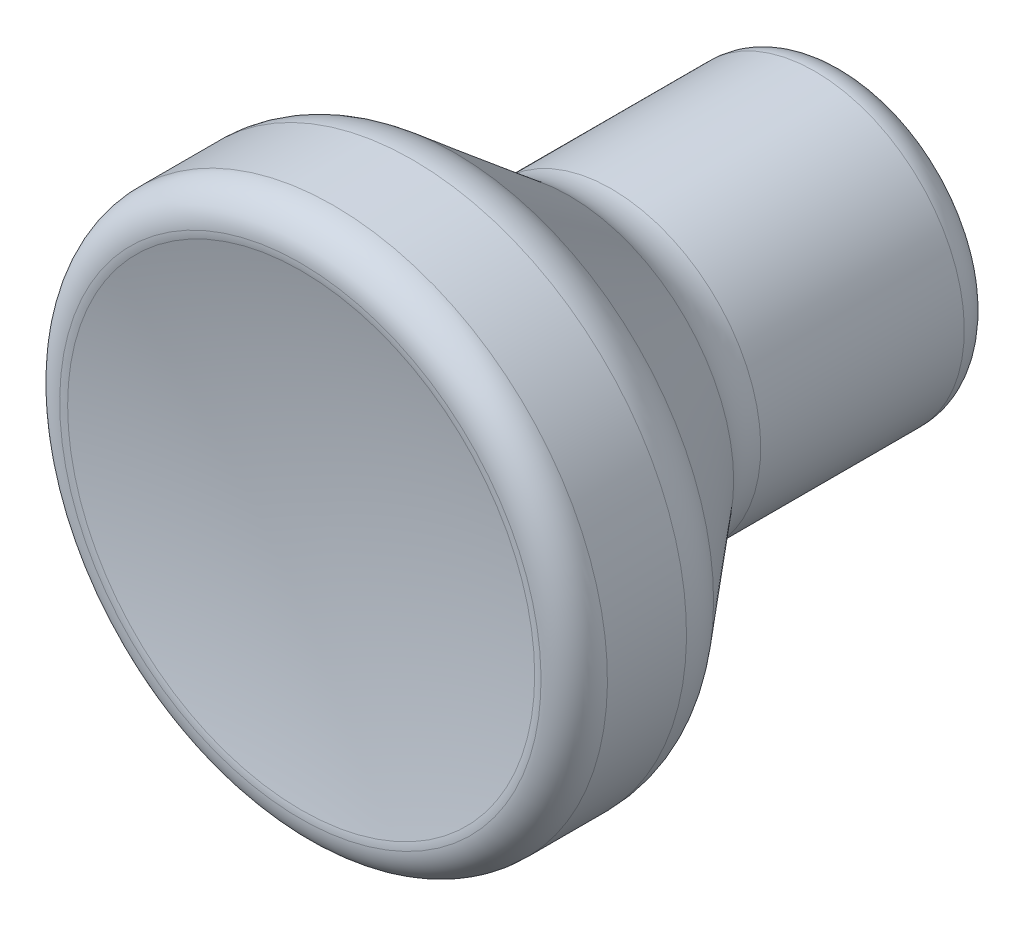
ISO-10303-21;
HEADER;
FILE_DESCRIPTION(('STEP AP214'),'2;1');
FILE_NAME('part.step','',(''),(''),'','','');
FILE_SCHEMA(('AUTOMOTIVE_DESIGN { 1 0 10303 214 1 1 1 1 }'));
ENDSEC;
DATA;
#1=APPLICATION_CONTEXT('core data for automotive mechanical design processes');
#2=APPLICATION_PROTOCOL_DEFINITION('international standard','automotive_design',2000,#1);
#3=PRODUCT_CONTEXT('',#1,'mechanical');
#4=PRODUCT('Part','Part','',(#3));
#5=PRODUCT_RELATED_PRODUCT_CATEGORY('part','',(#4));
#6=PRODUCT_DEFINITION_FORMATION('','',#4);
#7=PRODUCT_DEFINITION_CONTEXT('part definition',#1,'design');
#8=PRODUCT_DEFINITION('design','',#6,#7);
#9=PRODUCT_DEFINITION_SHAPE('','',#8);
#10=(LENGTH_UNIT() NAMED_UNIT(*) SI_UNIT(.MILLI.,.METRE.));
#11=(NAMED_UNIT(*) PLANE_ANGLE_UNIT() SI_UNIT($,.RADIAN.));
#12=(NAMED_UNIT(*) SI_UNIT($,.STERADIAN.) SOLID_ANGLE_UNIT());
#13=UNCERTAINTY_MEASURE_WITH_UNIT(LENGTH_MEASURE(1.E-05),#10,'distance_accuracy_value','');
#14=(GEOMETRIC_REPRESENTATION_CONTEXT(3) GLOBAL_UNCERTAINTY_ASSIGNED_CONTEXT((#13)) GLOBAL_UNIT_ASSIGNED_CONTEXT((#10,
#11,#12)) REPRESENTATION_CONTEXT('',''));
#15=CARTESIAN_POINT('',(0.,0.,0.));
#16=DIRECTION('',(0.,0.,1.));
#17=DIRECTION('',(1.,0.,0.));
#18=AXIS2_PLACEMENT_3D('',#15,#16,#17);
#19=CARTESIAN_POINT('',(0.,-0.138898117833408,97.4056));
#20=DIRECTION('',(-1.,0.,0.));
#21=DIRECTION('',(0.,1.,0.));
#22=AXIS2_PLACEMENT_3D('',#19,#20,#21);
#23=CIRCLE('',#22,66.000015);
#24=TRIMMED_CURVE('',#23,(PARAMETER_VALUE(-1.56869180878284)),
(PARAMETER_VALUE(1.56869180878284)),.T.,.PARAMETER.);
#25=CARTESIAN_POINT('',(0.,0.,97.4056));
#26=DIRECTION('',(0.,0.,-1.));
#27=AXIS1_PLACEMENT('',#25,#26);
#28=SURFACE_OF_REVOLUTION('',#24,#27);
#29=CARTESIAN_POINT('',(0.,0.,32.9531007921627));
#30=DIRECTION('',(0.,0.,-1.));
#31=DIRECTION('',(0.,1.,0.));
#32=AXIS2_PLACEMENT_3D('',#29,#30,#31);
#33=CIRCLE('',#32,14.0694559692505);
#34=CARTESIAN_POINT('',(0.,14.0694559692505,32.9531007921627));
#35=VERTEX_POINT('',#34);
#36=EDGE_CURVE('E110',#35,#35,#33,.T.);
#37=ORIENTED_EDGE('',*,*,#36,.F.);
#38=EDGE_LOOP('',(#37));
#39=FACE_BOUND('',#38,.T.);
#40=CARTESIAN_POINT('',(0.,0.,31.4057311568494));
#41=VERTEX_POINT('',#40);
#42=VERTEX_LOOP('',#41);
#43=FACE_BOUND('',#42,.T.);
#44=ADVANCED_FACE('F14',(#39,#43),#28,.F.);
#45=CARTESIAN_POINT('',(0.,0.,30.9999960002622));
#46=DIRECTION('',(0.,0.,-1.));
#47=DIRECTION('',(0.,1.,0.));
#48=AXIS2_PLACEMENT_3D('',#45,#46,#47);
#49=TOROIDAL_SURFACE('',#48,14.5000342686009,2.000004);
#50=CARTESIAN_POINT('',(0.,0.,33.));
#51=DIRECTION('',(0.,0.,-1.));
#52=DIRECTION('',(0.,1.,0.));
#53=AXIS2_PLACEMENT_3D('',#50,#51,#52);
#54=CIRCLE('',#53,14.5000018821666);
#55=CARTESIAN_POINT('',(0.,14.5000018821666,33.));
#56=VERTEX_POINT('',#55);
#57=EDGE_CURVE('E107',#56,#56,#54,.T.);
#58=ORIENTED_EDGE('',*,*,#57,.F.);
#59=EDGE_LOOP('',(#58));
#60=FACE_BOUND('',#59,.T.);
#61=ORIENTED_EDGE('',*,*,#36,.T.);
#62=EDGE_LOOP('',(#61));
#63=FACE_BOUND('',#62,.T.);
#64=ADVANCED_FACE('F25',(#60,#63),#49,.T.);
#65=CARTESIAN_POINT('',(0.,0.,31.));
#66=DIRECTION('',(0.,0.,-1.));
#67=DIRECTION('',(0.,1.,0.));
#68=AXIS2_PLACEMENT_3D('',#65,#66,#67);
#69=TOROIDAL_SURFACE('',#68,14.5000018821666,2.);
#70=CARTESIAN_POINT('',(0.,0.,31.));
#71=DIRECTION('',(0.,0.,-1.));
#72=DIRECTION('',(0.,1.,0.));
#73=AXIS2_PLACEMENT_3D('',#70,#71,#72);
#74=CIRCLE('',#73,16.5000018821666);
#75=CARTESIAN_POINT('',(0.,16.5000018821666,31.));
#76=VERTEX_POINT('',#75);
#77=EDGE_CURVE('E104',#76,#76,#74,.T.);
#78=ORIENTED_EDGE('',*,*,#77,.F.);
#79=EDGE_LOOP('',(#78));
#80=FACE_BOUND('',#79,.T.);
#81=ORIENTED_EDGE('',*,*,#57,.T.);
#82=EDGE_LOOP('',(#81));
#83=FACE_BOUND('',#82,.T.);
#84=ADVANCED_FACE('F32',(#80,#83),#69,.T.);
#85=CARTESIAN_POINT('',(0.,0.,-3.));
#86=DIRECTION('',(0.,0.,-1.));
#87=DIRECTION('',(0.,1.,0.));
#88=AXIS2_PLACEMENT_3D('',#85,#86,#87);
#89=CYLINDRICAL_SURFACE('',#88,16.5000018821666);
#90=CARTESIAN_POINT('',(0.,0.,26.23595));
#91=DIRECTION('',(0.,0.,-1.));
#92=DIRECTION('',(0.,1.,0.));
#93=AXIS2_PLACEMENT_3D('',#90,#91,#92);
#94=CIRCLE('',#93,16.5000018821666);
#95=CARTESIAN_POINT('',(0.,16.5000018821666,26.23595));
#96=VERTEX_POINT('',#95);
#97=EDGE_CURVE('E101',#96,#96,#94,.T.);
#98=ORIENTED_EDGE('',*,*,#97,.F.);
#99=EDGE_LOOP('',(#98));
#100=FACE_BOUND('',#99,.T.);
#101=ORIENTED_EDGE('',*,*,#77,.T.);
#102=EDGE_LOOP('',(#101));
#103=FACE_BOUND('',#102,.T.);
#104=ADVANCED_FACE('F39',(#100,#103),#89,.T.);
#105=CARTESIAN_POINT('',(0.,0.,26.2359075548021));
#106=DIRECTION('',(0.,0.,-1.));
#107=DIRECTION('',(0.,1.,0.));
#108=AXIS2_PLACEMENT_3D('',#105,#106,#107);
#109=TOROIDAL_SURFACE('',#108,12.5000018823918,4.);
#110=CARTESIAN_POINT('',(0.,0.,23.6919));
#111=DIRECTION('',(0.,0.,-1.));
#112=DIRECTION('',(0.,1.,0.));
#113=AXIS2_PLACEMENT_3D('',#110,#111,#112);
#114=CIRCLE('',#113,15.5867518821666);
#115=CARTESIAN_POINT('',(0.,15.5867518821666,23.6919));
#116=VERTEX_POINT('',#115);
#117=EDGE_CURVE('E98',#116,#116,#114,.T.);
#118=ORIENTED_EDGE('',*,*,#117,.F.);
#119=EDGE_LOOP('',(#118));
#120=FACE_BOUND('',#119,.T.);
#121=ORIENTED_EDGE('',*,*,#97,.T.);
#122=EDGE_LOOP('',(#121));
#123=FACE_BOUND('',#122,.T.);
#124=ADVANCED_FACE('F43',(#120,#123),#109,.T.);
#125=CARTESIAN_POINT('',(0.,0.,23.6919));
#126=DIRECTION('',(0.,0.,1.));
#127=DIRECTION('',(0.,-1.,0.));
#128=AXIS2_PLACEMENT_3D('',#125,#126,#127);
#129=CONICAL_SURFACE('',#128,15.5867518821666,0.68931277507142);
#130=CARTESIAN_POINT('',(0.,0.,16.8081));
#131=DIRECTION('',(0.,0.,-1.));
#132=DIRECTION('',(0.,1.,0.));
#133=AXIS2_PLACEMENT_3D('',#130,#131,#132);
#134=CIRCLE('',#133,9.91325188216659);
#135=CARTESIAN_POINT('',(0.,9.91325188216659,16.8081));
#136=VERTEX_POINT('',#135);
#137=EDGE_CURVE('E95',#136,#136,#134,.T.);
#138=ORIENTED_EDGE('',*,*,#137,.F.);
#139=EDGE_LOOP('',(#138));
#140=FACE_BOUND('',#139,.T.);
#141=ORIENTED_EDGE('',*,*,#117,.T.);
#142=EDGE_LOOP('',(#141));
#143=FACE_BOUND('',#142,.T.);
#144=ADVANCED_FACE('F47',(#140,#143),#129,.T.);
#145=CARTESIAN_POINT('',(0.,0.,14.2640924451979));
#146=DIRECTION('',(0.,0.,-1.));
#147=DIRECTION('',(0.,1.,0.));
#148=AXIS2_PLACEMENT_3D('',#145,#146,#147);
#149=TOROIDAL_SURFACE('',#148,13.0000018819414,4.);
#150=CARTESIAN_POINT('',(0.,0.,14.26405));
#151=DIRECTION('',(0.,0.,-1.));
#152=DIRECTION('',(0.,1.,0.));
#153=AXIS2_PLACEMENT_3D('',#150,#151,#152);
#154=CIRCLE('',#153,9.00000188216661);
#155=CARTESIAN_POINT('',(0.,9.00000188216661,14.26405));
#156=VERTEX_POINT('',#155);
#157=EDGE_CURVE('E92',#156,#156,#154,.T.);
#158=ORIENTED_EDGE('',*,*,#157,.F.);
#159=EDGE_LOOP('',(#158));
#160=FACE_BOUND('',#159,.T.);
#161=ORIENTED_EDGE('',*,*,#137,.T.);
#162=EDGE_LOOP('',(#161));
#163=FACE_BOUND('',#162,.T.);
#164=ADVANCED_FACE('F51',(#160,#163),#149,.F.);
#165=CARTESIAN_POINT('',(0.,0.,-3.));
#166=DIRECTION('',(0.,0.,-1.));
#167=DIRECTION('',(0.,1.,0.));
#168=AXIS2_PLACEMENT_3D('',#165,#166,#167);
#169=CYLINDRICAL_SURFACE('',#168,9.00000188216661);
#170=CARTESIAN_POINT('',(0.,0.,2.));
#171=DIRECTION('',(0.,0.,-1.));
#172=DIRECTION('',(0.,1.,0.));
#173=AXIS2_PLACEMENT_3D('',#170,#171,#172);
#174=CIRCLE('',#173,9.00000188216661);
#175=CARTESIAN_POINT('',(0.,9.00000188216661,2.));
#176=VERTEX_POINT('',#175);
#177=EDGE_CURVE('E87',#176,#176,#174,.T.);
#178=ORIENTED_EDGE('',*,*,#177,.F.);
#179=EDGE_LOOP('',(#178));
#180=FACE_BOUND('',#179,.T.);
#181=ORIENTED_EDGE('',*,*,#157,.T.);
#182=EDGE_LOOP('',(#181));
#183=FACE_BOUND('',#182,.T.);
#184=ADVANCED_FACE('F55',(#180,#183),#169,.T.);
#185=CARTESIAN_POINT('',(0.,0.,2.));
#186=DIRECTION('',(0.,0.,-1.));
#187=DIRECTION('',(0.,1.,0.));
#188=AXIS2_PLACEMENT_3D('',#185,#186,#187);
#189=TOROIDAL_SURFACE('',#188,7.00000188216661,2.);
#190=CARTESIAN_POINT('',(0.,0.,0.));
#191=DIRECTION('',(0.,0.,-1.));
#192=DIRECTION('',(0.,1.,0.));
#193=AXIS2_PLACEMENT_3D('',#190,#191,#192);
#194=CIRCLE('',#193,7.00000188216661);
#195=CARTESIAN_POINT('',(0.,7.00000188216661,0.));
#196=VERTEX_POINT('',#195);
#197=EDGE_CURVE('E84',#196,#196,#194,.T.);
#198=ORIENTED_EDGE('',*,*,#197,.F.);
#199=EDGE_LOOP('',(#198));
#200=FACE_BOUND('',#199,.T.);
#201=ORIENTED_EDGE('',*,*,#177,.T.);
#202=EDGE_LOOP('',(#201));
#203=FACE_BOUND('',#202,.T.);
#204=ADVANCED_FACE('F59',(#200,#203),#189,.T.);
#205=CARTESIAN_POINT('',(-4.0235,0.,0.));
#206=DIRECTION('',(0.,0.,1.));
#207=DIRECTION('',(0.,-1.,0.));
#208=AXIS2_PLACEMENT_3D('',#205,#206,#207);
#209=PLANE('',#208);
#210=CARTESIAN_POINT('',(0.,0.,0.));
#211=DIRECTION('',(0.,0.,1.));
#212=DIRECTION('',(0.,-1.,0.));
#213=AXIS2_PLACEMENT_3D('',#210,#211,#212);
#214=CIRCLE('',#213,4.5234975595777);
#215=CARTESIAN_POINT('',(0.,-4.5234975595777,0.));
#216=VERTEX_POINT('',#215);
#217=EDGE_CURVE('E9',#216,#216,#214,.T.);
#218=ORIENTED_EDGE('',*,*,#217,.T.);
#219=EDGE_LOOP('',(#218));
#220=FACE_BOUND('',#219,.T.);
#221=ORIENTED_EDGE('',*,*,#197,.T.);
#222=EDGE_LOOP('',(#221));
#223=FACE_BOUND('',#222,.T.);
#224=ADVANCED_FACE('F63',(#220,#223),#209,.F.);
#225=CARTESIAN_POINT('',(0.,0.,-3.));
#226=DIRECTION('',(0.,0.,-1.));
#227=DIRECTION('',(0.,1.,0.));
#228=AXIS2_PLACEMENT_3D('',#225,#226,#227);
#229=CYLINDRICAL_SURFACE('',#228,3.99999902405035);
#230=CARTESIAN_POINT('',(0.,0.,0.523498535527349));
#231=DIRECTION('',(0.,0.,1.));
#232=DIRECTION('',(0.,-1.,0.));
#233=AXIS2_PLACEMENT_3D('',#230,#231,#232);
#234=CIRCLE('',#233,3.99999902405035);
#235=CARTESIAN_POINT('',(0.,-3.99999902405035,0.523498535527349));
#236=VERTEX_POINT('',#235);
#237=EDGE_CURVE('E21',#236,#236,#234,.F.);
#238=ORIENTED_EDGE('',*,*,#237,.T.);
#239=EDGE_LOOP('',(#238));
#240=FACE_BOUND('',#239,.T.);
#241=CARTESIAN_POINT('',(0.,0.,13.9999997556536));
#242=DIRECTION('',(0.,0.,-1.));
#243=DIRECTION('',(0.,1.,0.));
#244=AXIS2_PLACEMENT_3D('',#241,#242,#243);
#245=CIRCLE('',#244,4.);
#246=CARTESIAN_POINT('',(0.,4.,13.9999997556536));
#247=VERTEX_POINT('',#246);
#248=EDGE_CURVE('E82',#247,#247,#245,.T.);
#249=ORIENTED_EDGE('',*,*,#248,.F.);
#250=EDGE_LOOP('',(#249));
#251=FACE_BOUND('',#250,.T.);
#252=ADVANCED_FACE('F67',(#240,#251),#229,.F.);
#253=CARTESIAN_POINT('',(0.,0.,13.9999997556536));
#254=DIRECTION('',(0.,0.,-1.));
#255=DIRECTION('',(0.,1.,0.));
#256=AXIS2_PLACEMENT_3D('',#253,#254,#255);
#257=PLANE('',#256);
#258=ORIENTED_EDGE('',*,*,#248,.T.);
#259=EDGE_LOOP('',(#258));
#260=FACE_BOUND('',#259,.T.);
#261=ADVANCED_FACE('F71',(#260),#257,.T.);
#262=CARTESIAN_POINT('',(0.,0.,0.523498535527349));
#263=DIRECTION('',(0.,0.,-1.));
#264=DIRECTION('',(0.,1.,0.));
#265=AXIS2_PLACEMENT_3D('',#262,#263,#264);
#266=CONICAL_SURFACE('',#265,3.99999902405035,0.78539816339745);
#267=ORIENTED_EDGE('',*,*,#217,.F.);
#268=EDGE_LOOP('',(#267));
#269=FACE_BOUND('',#268,.T.);
#270=ORIENTED_EDGE('',*,*,#237,.F.);
#271=EDGE_LOOP('',(#270));
#272=FACE_BOUND('',#271,.T.);
#273=ADVANCED_FACE('F16',(#269,#272),#266,.F.);
#274=CLOSED_SHELL('',(#44,#64,#84,#104,#124,#144,#164,#184,#204,#224,#252,#261,#273));
#275=MANIFOLD_SOLID_BREP('B1',#274);
#276=ADVANCED_BREP_SHAPE_REPRESENTATION('',(#18,#275),#14);
#277=SHAPE_DEFINITION_REPRESENTATION(#9,#276);
ENDSEC;
END-ISO-10303-21;
